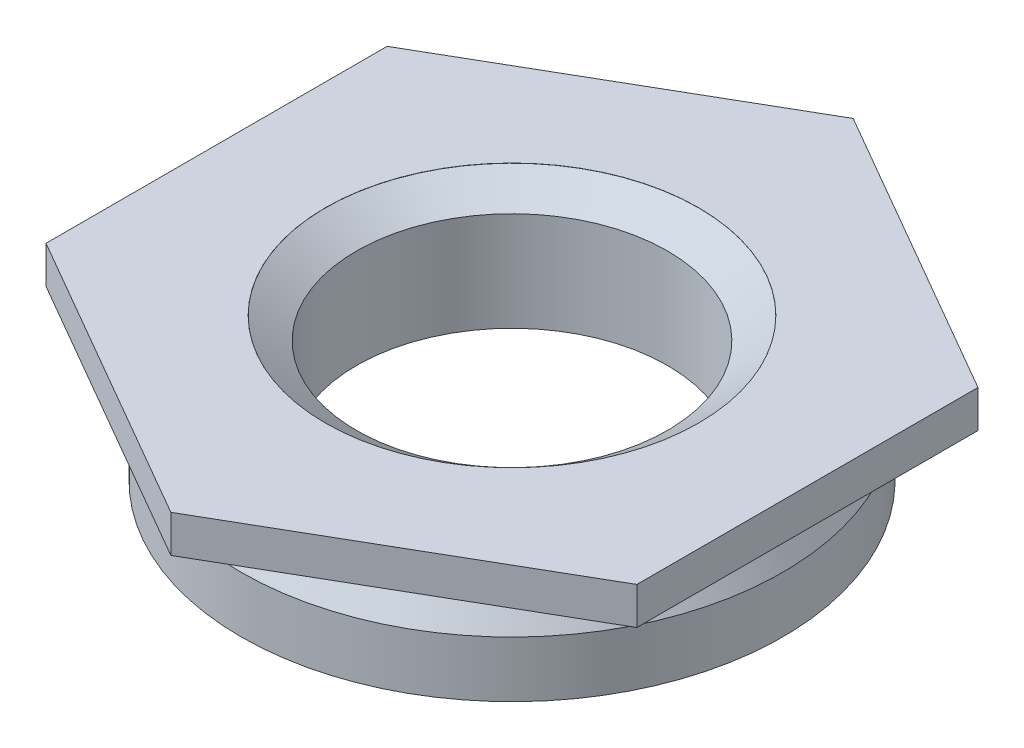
ISO-10303-21;
HEADER;
FILE_DESCRIPTION(('STEP AP214'),'2;1');
FILE_NAME('part.step','',(''),(''),'','','');
FILE_SCHEMA(('AUTOMOTIVE_DESIGN { 1 0 10303 214 1 1 1 1 }'));
ENDSEC;
DATA;
#1=APPLICATION_CONTEXT('core data for automotive mechanical design processes');
#2=APPLICATION_PROTOCOL_DEFINITION('international standard','automotive_design',2000,#1);
#3=PRODUCT_CONTEXT('',#1,'mechanical');
#4=PRODUCT('Part','Part','',(#3));
#5=PRODUCT_RELATED_PRODUCT_CATEGORY('part','',(#4));
#6=PRODUCT_DEFINITION_FORMATION('','',#4);
#7=PRODUCT_DEFINITION_CONTEXT('part definition',#1,'design');
#8=PRODUCT_DEFINITION('design','',#6,#7);
#9=PRODUCT_DEFINITION_SHAPE('','',#8);
#10=(LENGTH_UNIT() NAMED_UNIT(*) SI_UNIT(.MILLI.,.METRE.));
#11=(NAMED_UNIT(*) PLANE_ANGLE_UNIT() SI_UNIT($,.RADIAN.));
#12=(NAMED_UNIT(*) SI_UNIT($,.STERADIAN.) SOLID_ANGLE_UNIT());
#13=UNCERTAINTY_MEASURE_WITH_UNIT(LENGTH_MEASURE(1.E-05),#10,'distance_accuracy_value','');
#14=(GEOMETRIC_REPRESENTATION_CONTEXT(3) GLOBAL_UNCERTAINTY_ASSIGNED_CONTEXT((#13)) GLOBAL_UNIT_ASSIGNED_CONTEXT((#10,
#11,#12)) REPRESENTATION_CONTEXT('',''));
#15=CARTESIAN_POINT('',(0.,0.,0.));
#16=DIRECTION('',(0.,0.,1.));
#17=DIRECTION('',(1.,0.,0.));
#18=AXIS2_PLACEMENT_3D('',#15,#16,#17);
#19=CARTESIAN_POINT('',(4.06632486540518,0.,0.));
#20=DIRECTION('',(0.,-1.,0.));
#21=DIRECTION('',(0.,0.,-1.));
#22=AXIS2_PLACEMENT_3D('',#19,#20,#21);
#23=PLANE('',#22);
#24=CARTESIAN_POINT('',(0.,0.,0.));
#25=DIRECTION('',(0.,-1.,0.));
#26=DIRECTION('',(0.,0.,-1.));
#27=AXIS2_PLACEMENT_3D('',#24,#25,#26);
#28=CIRCLE('',#27,4.06632486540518);
#29=CARTESIAN_POINT('',(0.,0.,-4.06632486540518));
#30=VERTEX_POINT('',#29);
#31=EDGE_CURVE('E11',#30,#30,#28,.T.);
#32=ORIENTED_EDGE('',*,*,#31,.F.);
#33=EDGE_LOOP('',(#32));
#34=FACE_BOUND('',#33,.T.);
#35=DIRECTION('',(0.,0.,-1.));
#36=VECTOR('',#35,1.);
#37=CARTESIAN_POINT('',(4.75,0.,-2.74241377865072));
#38=LINE('',#37,#36);
#39=CARTESIAN_POINT('',(4.75,0.,2.74241377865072));
#40=VERTEX_POINT('',#39);
#41=CARTESIAN_POINT('',(4.75,0.,-2.74241377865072));
#42=VERTEX_POINT('',#41);
#43=EDGE_CURVE('E104',#40,#42,#38,.T.);
#44=ORIENTED_EDGE('',*,*,#43,.F.);
#45=DIRECTION('',(0.866025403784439,0.,-0.5));
#46=VECTOR('',#45,1.);
#47=CARTESIAN_POINT('',(4.75,0.,2.74241377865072));
#48=LINE('',#47,#46);
#49=CARTESIAN_POINT('',(0.,0.,5.48482755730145));
#50=VERTEX_POINT('',#49);
#51=EDGE_CURVE('E49',#50,#40,#48,.T.);
#52=ORIENTED_EDGE('',*,*,#51,.F.);
#53=DIRECTION('',(0.866025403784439,0.,0.5));
#54=VECTOR('',#53,1.);
#55=CARTESIAN_POINT('',(0.,0.,5.48482755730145));
#56=LINE('',#55,#54);
#57=CARTESIAN_POINT('',(-4.75,0.,2.74241377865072));
#58=VERTEX_POINT('',#57);
#59=EDGE_CURVE('E110',#58,#50,#56,.T.);
#60=ORIENTED_EDGE('',*,*,#59,.F.);
#61=DIRECTION('',(0.,0.,1.));
#62=VECTOR('',#61,1.);
#63=CARTESIAN_POINT('',(-4.75,0.,2.74241377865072));
#64=LINE('',#63,#62);
#65=CARTESIAN_POINT('',(-4.75,0.,-2.74241377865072));
#66=VERTEX_POINT('',#65);
#67=EDGE_CURVE('E108',#66,#58,#64,.T.);
#68=ORIENTED_EDGE('',*,*,#67,.F.);
#69=DIRECTION('',(-0.866025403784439,0.,0.5));
#70=VECTOR('',#69,1.);
#71=CARTESIAN_POINT('',(-4.75,0.,-2.74241377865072));
#72=LINE('',#71,#70);
#73=CARTESIAN_POINT('',(0.,0.,-5.48482755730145));
#74=VERTEX_POINT('',#73);
#75=EDGE_CURVE('E91',#74,#66,#72,.T.);
#76=ORIENTED_EDGE('',*,*,#75,.F.);
#77=DIRECTION('',(-0.866025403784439,0.,-0.5));
#78=VECTOR('',#77,1.);
#79=CARTESIAN_POINT('',(0.,0.,-5.48482755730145));
#80=LINE('',#79,#78);
#81=EDGE_CURVE('E99',#42,#74,#80,.T.);
#82=ORIENTED_EDGE('',*,*,#81,.F.);
#83=EDGE_LOOP('',(#44,#52,#60,#68,#76,#82));
#84=FACE_BOUND('',#83,.T.);
#85=ADVANCED_FACE('F33',(#34,#84),#23,.T.);
#86=CARTESIAN_POINT('',(5.5095,0.6,0.));
#87=DIRECTION('',(0.,1.,0.));
#88=DIRECTION('',(0.,0.,1.));
#89=AXIS2_PLACEMENT_3D('',#86,#87,#88);
#90=PLANE('',#89);
#91=CARTESIAN_POINT('',(0.,0.6,0.));
#92=DIRECTION('',(0.,1.,0.));
#93=DIRECTION('',(0.,0.,1.));
#94=AXIS2_PLACEMENT_3D('',#91,#92,#93);
#95=CIRCLE('',#94,3.);
#96=CARTESIAN_POINT('',(0.,0.6,3.));
#97=VERTEX_POINT('',#96);
#98=EDGE_CURVE('E36',#97,#97,#95,.T.);
#99=ORIENTED_EDGE('',*,*,#98,.F.);
#100=EDGE_LOOP('',(#99));
#101=FACE_BOUND('',#100,.T.);
#102=DIRECTION('',(0.866025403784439,0.,0.5));
#103=VECTOR('',#102,1.);
#104=CARTESIAN_POINT('',(0.,0.6,5.48482755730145));
#105=LINE('',#104,#103);
#106=CARTESIAN_POINT('',(-4.75,0.6,2.74241377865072));
#107=VERTEX_POINT('',#106);
#108=CARTESIAN_POINT('',(0.,0.6,5.48482755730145));
#109=VERTEX_POINT('',#108);
#110=EDGE_CURVE('E128',#107,#109,#105,.T.);
#111=ORIENTED_EDGE('',*,*,#110,.T.);
#112=DIRECTION('',(0.866025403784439,0.,-0.5));
#113=VECTOR('',#112,1.);
#114=CARTESIAN_POINT('',(4.75,0.6,2.74241377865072));
#115=LINE('',#114,#113);
#116=CARTESIAN_POINT('',(4.75,0.6,2.74241377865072));
#117=VERTEX_POINT('',#116);
#118=EDGE_CURVE('E117',#109,#117,#115,.T.);
#119=ORIENTED_EDGE('',*,*,#118,.T.);
#120=DIRECTION('',(0.,0.,-1.));
#121=VECTOR('',#120,1.);
#122=CARTESIAN_POINT('',(4.75,0.6,-2.74241377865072));
#123=LINE('',#122,#121);
#124=CARTESIAN_POINT('',(4.75,0.6,-2.74241377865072));
#125=VERTEX_POINT('',#124);
#126=EDGE_CURVE('E120',#117,#125,#123,.T.);
#127=ORIENTED_EDGE('',*,*,#126,.T.);
#128=DIRECTION('',(-0.866025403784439,0.,-0.5));
#129=VECTOR('',#128,1.);
#130=CARTESIAN_POINT('',(0.,0.6,-5.48482755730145));
#131=LINE('',#130,#129);
#132=CARTESIAN_POINT('',(0.,0.6,-5.48482755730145));
#133=VERTEX_POINT('',#132);
#134=EDGE_CURVE('E57',#125,#133,#131,.T.);
#135=ORIENTED_EDGE('',*,*,#134,.T.);
#136=DIRECTION('',(-0.866025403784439,0.,0.5));
#137=VECTOR('',#136,1.);
#138=CARTESIAN_POINT('',(-4.75,0.6,-2.74241377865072));
#139=LINE('',#138,#137);
#140=CARTESIAN_POINT('',(-4.75,0.6,-2.74241377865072));
#141=VERTEX_POINT('',#140);
#142=EDGE_CURVE('E94',#133,#141,#139,.T.);
#143=ORIENTED_EDGE('',*,*,#142,.T.);
#144=DIRECTION('',(0.,0.,1.));
#145=VECTOR('',#144,1.);
#146=CARTESIAN_POINT('',(-4.75,0.6,2.74241377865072));
#147=LINE('',#146,#145);
#148=EDGE_CURVE('E125',#141,#107,#147,.T.);
#149=ORIENTED_EDGE('',*,*,#148,.T.);
#150=EDGE_LOOP('',(#111,#119,#127,#135,#143,#149));
#151=FACE_BOUND('',#150,.T.);
#152=ADVANCED_FACE('F183',(#101,#151),#90,.T.);
#153=CARTESIAN_POINT('',(0.,0.,0.));
#154=DIRECTION('',(0.,-1.,0.));
#155=DIRECTION('',(0.,0.,-1.));
#156=AXIS2_PLACEMENT_3D('',#153,#154,#155);
#157=CYLINDRICAL_SURFACE('',#156,4.06632486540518);
#158=ORIENTED_EDGE('',*,*,#31,.T.);
#159=EDGE_LOOP('',(#158));
#160=FACE_BOUND('',#159,.T.);
#161=CARTESIAN_POINT('',(0.,-0.3,0.));
#162=DIRECTION('',(0.,-1.,0.));
#163=DIRECTION('',(0.,0.,-1.));
#164=AXIS2_PLACEMENT_3D('',#161,#162,#163);
#165=CIRCLE('',#164,4.06632486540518);
#166=CARTESIAN_POINT('',(0.,-0.3,-4.06632486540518));
#167=VERTEX_POINT('',#166);
#168=EDGE_CURVE('E41',#167,#167,#165,.T.);
#169=ORIENTED_EDGE('',*,*,#168,.F.);
#170=EDGE_LOOP('',(#169));
#171=FACE_BOUND('',#170,.T.);
#172=ADVANCED_FACE('F179',(#160,#171),#157,.T.);
#173=CARTESIAN_POINT('',(0.,-0.8,0.));
#174=DIRECTION('',(0.,-1.,0.));
#175=DIRECTION('',(0.,0.,-1.));
#176=AXIS2_PLACEMENT_3D('',#173,#174,#175);
#177=CONICAL_SURFACE('',#176,4.355,0.523598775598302);
#178=ORIENTED_EDGE('',*,*,#168,.T.);
#179=EDGE_LOOP('',(#178));
#180=FACE_BOUND('',#179,.T.);
#181=CARTESIAN_POINT('',(0.,-0.8,0.));
#182=DIRECTION('',(0.,-1.,0.));
#183=DIRECTION('',(0.,0.,-1.));
#184=AXIS2_PLACEMENT_3D('',#181,#182,#183);
#185=CIRCLE('',#184,4.355);
#186=CARTESIAN_POINT('',(0.,-0.8,-4.355));
#187=VERTEX_POINT('',#186);
#188=EDGE_CURVE('E154',#187,#187,#185,.T.);
#189=ORIENTED_EDGE('',*,*,#188,.F.);
#190=EDGE_LOOP('',(#189));
#191=FACE_BOUND('',#190,.T.);
#192=ADVANCED_FACE('F173',(#180,#191),#177,.T.);
#193=CARTESIAN_POINT('',(0.,0.,0.));
#194=DIRECTION('',(0.,-1.,0.));
#195=DIRECTION('',(0.,0.,-1.));
#196=AXIS2_PLACEMENT_3D('',#193,#194,#195);
#197=CYLINDRICAL_SURFACE('',#196,4.355);
#198=ORIENTED_EDGE('',*,*,#188,.T.);
#199=EDGE_LOOP('',(#198));
#200=FACE_BOUND('',#199,.T.);
#201=CARTESIAN_POINT('',(0.,-1.7,0.));
#202=DIRECTION('',(0.,-1.,0.));
#203=DIRECTION('',(0.,0.,-1.));
#204=AXIS2_PLACEMENT_3D('',#201,#202,#203);
#205=CIRCLE('',#204,4.355);
#206=CARTESIAN_POINT('',(0.,-1.7,-4.355));
#207=VERTEX_POINT('',#206);
#208=EDGE_CURVE('E151',#207,#207,#205,.T.);
#209=ORIENTED_EDGE('',*,*,#208,.F.);
#210=EDGE_LOOP('',(#209));
#211=FACE_BOUND('',#210,.T.);
#212=ADVANCED_FACE('F168',(#200,#211),#197,.T.);
#213=CARTESIAN_POINT('',(2.5,-1.7,0.));
#214=DIRECTION('',(0.,-1.,0.));
#215=DIRECTION('',(0.,0.,-1.));
#216=AXIS2_PLACEMENT_3D('',#213,#214,#215);
#217=PLANE('',#216);
#218=CARTESIAN_POINT('',(0.,-1.7,0.));
#219=DIRECTION('',(0.,-1.,0.));
#220=DIRECTION('',(0.,0.,-1.));
#221=AXIS2_PLACEMENT_3D('',#218,#219,#220);
#222=CIRCLE('',#221,3.);
#223=CARTESIAN_POINT('',(0.,-1.7,-3.));
#224=VERTEX_POINT('',#223);
#225=EDGE_CURVE('E150',#224,#224,#222,.T.);
#226=ORIENTED_EDGE('',*,*,#225,.F.);
#227=EDGE_LOOP('',(#226));
#228=FACE_BOUND('',#227,.T.);
#229=ORIENTED_EDGE('',*,*,#208,.T.);
#230=EDGE_LOOP('',(#229));
#231=FACE_BOUND('',#230,.T.);
#232=ADVANCED_FACE('F164',(#228,#231),#217,.T.);
#233=CARTESIAN_POINT('',(0.,0.,0.));
#234=DIRECTION('',(0.,-1.,0.));
#235=DIRECTION('',(0.,0.,-1.));
#236=AXIS2_PLACEMENT_3D('',#233,#234,#235);
#237=CYLINDRICAL_SURFACE('',#236,2.5);
#238=CARTESIAN_POINT('',(0.,0.247486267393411,0.));
#239=DIRECTION('',(0.,-1.,0.));
#240=DIRECTION('',(0.,0.,-1.));
#241=AXIS2_PLACEMENT_3D('',#238,#239,#240);
#242=CIRCLE('',#241,2.5);
#243=CARTESIAN_POINT('',(0.,0.247486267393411,-2.5));
#244=VERTEX_POINT('',#243);
#245=EDGE_CURVE('E141',#244,#244,#242,.T.);
#246=ORIENTED_EDGE('',*,*,#245,.F.);
#247=EDGE_LOOP('',(#246));
#248=FACE_BOUND('',#247,.T.);
#249=CARTESIAN_POINT('',(0.,-1.34748626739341,0.));
#250=DIRECTION('',(0.,-1.,0.));
#251=DIRECTION('',(0.,0.,-1.));
#252=AXIS2_PLACEMENT_3D('',#249,#250,#251);
#253=CIRCLE('',#252,2.5);
#254=CARTESIAN_POINT('',(0.,-1.34748626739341,-2.5));
#255=VERTEX_POINT('',#254);
#256=EDGE_CURVE('E144',#255,#255,#253,.T.);
#257=ORIENTED_EDGE('',*,*,#256,.T.);
#258=EDGE_LOOP('',(#257));
#259=FACE_BOUND('',#258,.T.);
#260=ADVANCED_FACE('F167',(#248,#259),#237,.F.);
#261=CARTESIAN_POINT('',(0.,-2.54,0.));
#262=DIRECTION('',(0.,-1.,0.));
#263=DIRECTION('',(0.,0.,-1.));
#264=AXIS2_PLACEMENT_3D('',#261,#262,#263);
#265=CYLINDRICAL_SURFACE('',#264,3.);
#266=ORIENTED_EDGE('',*,*,#225,.T.);
#267=EDGE_LOOP('',(#266));
#268=FACE_BOUND('',#267,.T.);
#269=CARTESIAN_POINT('',(0.,-1.69746,0.));
#270=DIRECTION('',(0.,-1.,0.));
#271=DIRECTION('',(0.,0.,-1.));
#272=AXIS2_PLACEMENT_3D('',#269,#270,#271);
#273=CIRCLE('',#272,3.);
#274=CARTESIAN_POINT('',(0.,-1.69746,-3.));
#275=VERTEX_POINT('',#274);
#276=EDGE_CURVE('E147',#275,#275,#273,.T.);
#277=ORIENTED_EDGE('',*,*,#276,.F.);
#278=EDGE_LOOP('',(#277));
#279=FACE_BOUND('',#278,.T.);
#280=ADVANCED_FACE('F161',(#268,#279),#265,.F.);
#281=CARTESIAN_POINT('',(0.,-1.69746,0.));
#282=DIRECTION('',(0.,-1.,0.));
#283=DIRECTION('',(0.,0.,-1.));
#284=AXIS2_PLACEMENT_3D('',#281,#282,#283);
#285=CONICAL_SURFACE('',#284,3.,0.960105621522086);
#286=ORIENTED_EDGE('',*,*,#256,.F.);
#287=EDGE_LOOP('',(#286));
#288=FACE_BOUND('',#287,.T.);
#289=ORIENTED_EDGE('',*,*,#276,.T.);
#290=EDGE_LOOP('',(#289));
#291=FACE_BOUND('',#290,.T.);
#292=ADVANCED_FACE('F233',(#288,#291),#285,.F.);
#293=CARTESIAN_POINT('',(0.,-2.54,0.));
#294=DIRECTION('',(0.,-1.,0.));
#295=DIRECTION('',(0.,0.,-1.));
#296=AXIS2_PLACEMENT_3D('',#293,#294,#295);
#297=CYLINDRICAL_SURFACE('',#296,3.);
#298=ORIENTED_EDGE('',*,*,#98,.T.);
#299=EDGE_LOOP('',(#298));
#300=FACE_BOUND('',#299,.T.);
#301=CARTESIAN_POINT('',(0.,0.59746,0.));
#302=DIRECTION('',(0.,-1.,0.));
#303=DIRECTION('',(0.,0.,-1.));
#304=AXIS2_PLACEMENT_3D('',#301,#302,#303);
#305=CIRCLE('',#304,3.);
#306=CARTESIAN_POINT('',(0.,0.59746,-3.));
#307=VERTEX_POINT('',#306);
#308=EDGE_CURVE('E133',#307,#307,#305,.T.);
#309=ORIENTED_EDGE('',*,*,#308,.T.);
#310=EDGE_LOOP('',(#309));
#311=FACE_BOUND('',#310,.T.);
#312=ADVANCED_FACE('F242',(#300,#311),#297,.F.);
#313=CARTESIAN_POINT('',(0.,0.247486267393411,0.));
#314=DIRECTION('',(0.,1.,0.));
#315=DIRECTION('',(0.,0.,1.));
#316=AXIS2_PLACEMENT_3D('',#313,#314,#315);
#317=CONICAL_SURFACE('',#316,2.5,0.960105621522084);
#318=ORIENTED_EDGE('',*,*,#308,.F.);
#319=EDGE_LOOP('',(#318));
#320=FACE_BOUND('',#319,.T.);
#321=ORIENTED_EDGE('',*,*,#245,.T.);
#322=EDGE_LOOP('',(#321));
#323=FACE_BOUND('',#322,.T.);
#324=ADVANCED_FACE('F252',(#320,#323),#317,.F.);
#325=CARTESIAN_POINT('',(4.75,0.,2.74241377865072));
#326=DIRECTION('',(0.5,0.,0.866025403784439));
#327=DIRECTION('',(0.866025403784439,0.,-0.5));
#328=AXIS2_PLACEMENT_3D('',#325,#326,#327);
#329=PLANE('',#328);
#330=ORIENTED_EDGE('',*,*,#118,.F.);
#331=DIRECTION('',(0.,1.,0.));
#332=VECTOR('',#331,1.);
#333=CARTESIAN_POINT('',(0.,0.,5.48482755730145));
#334=LINE('',#333,#332);
#335=EDGE_CURVE('E131',#50,#109,#334,.T.);
#336=ORIENTED_EDGE('',*,*,#335,.F.);
#337=ORIENTED_EDGE('',*,*,#51,.T.);
#338=DIRECTION('',(0.,1.,0.));
#339=VECTOR('',#338,1.);
#340=CARTESIAN_POINT('',(4.75,0.,2.74241377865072));
#341=LINE('',#340,#339);
#342=EDGE_CURVE('E116',#40,#117,#341,.T.);
#343=ORIENTED_EDGE('',*,*,#342,.T.);
#344=EDGE_LOOP('',(#330,#336,#337,#343));
#345=FACE_BOUND('',#344,.T.);
#346=ADVANCED_FACE('F261',(#345),#329,.T.);
#347=CARTESIAN_POINT('',(0.,0.,5.48482755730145));
#348=DIRECTION('',(-0.5,0.,0.866025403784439));
#349=DIRECTION('',(0.866025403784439,0.,0.5));
#350=AXIS2_PLACEMENT_3D('',#347,#348,#349);
#351=PLANE('',#350);
#352=ORIENTED_EDGE('',*,*,#110,.F.);
#353=DIRECTION('',(0.,1.,0.));
#354=VECTOR('',#353,1.);
#355=CARTESIAN_POINT('',(-4.75,0.,2.74241377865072));
#356=LINE('',#355,#354);
#357=EDGE_CURVE('E134',#58,#107,#356,.T.);
#358=ORIENTED_EDGE('',*,*,#357,.F.);
#359=ORIENTED_EDGE('',*,*,#59,.T.);
#360=ORIENTED_EDGE('',*,*,#335,.T.);
#361=EDGE_LOOP('',(#352,#358,#359,#360));
#362=FACE_BOUND('',#361,.T.);
#363=ADVANCED_FACE('F280',(#362),#351,.T.);
#364=CARTESIAN_POINT('',(-4.75,0.,2.74241377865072));
#365=DIRECTION('',(-1.,0.,0.));
#366=DIRECTION('',(0.,0.,1.));
#367=AXIS2_PLACEMENT_3D('',#364,#365,#366);
#368=PLANE('',#367);
#369=ORIENTED_EDGE('',*,*,#148,.F.);
#370=DIRECTION('',(0.,1.,0.));
#371=VECTOR('',#370,1.);
#372=CARTESIAN_POINT('',(-4.75,0.,-2.74241377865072));
#373=LINE('',#372,#371);
#374=EDGE_CURVE('E95',#66,#141,#373,.T.);
#375=ORIENTED_EDGE('',*,*,#374,.F.);
#376=ORIENTED_EDGE('',*,*,#67,.T.);
#377=ORIENTED_EDGE('',*,*,#357,.T.);
#378=EDGE_LOOP('',(#369,#375,#376,#377));
#379=FACE_BOUND('',#378,.T.);
#380=ADVANCED_FACE('F289',(#379),#368,.T.);
#381=CARTESIAN_POINT('',(-4.75,0.,-2.74241377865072));
#382=DIRECTION('',(-0.5,0.,-0.866025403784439));
#383=DIRECTION('',(-0.866025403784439,0.,0.5));
#384=AXIS2_PLACEMENT_3D('',#381,#382,#383);
#385=PLANE('',#384);
#386=ORIENTED_EDGE('',*,*,#142,.F.);
#387=DIRECTION('',(0.,1.,0.));
#388=VECTOR('',#387,1.);
#389=CARTESIAN_POINT('',(0.,0.,-5.48482755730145));
#390=LINE('',#389,#388);
#391=EDGE_CURVE('E87',#74,#133,#390,.T.);
#392=ORIENTED_EDGE('',*,*,#391,.F.);
#393=ORIENTED_EDGE('',*,*,#75,.T.);
#394=ORIENTED_EDGE('',*,*,#374,.T.);
#395=EDGE_LOOP('',(#386,#392,#393,#394));
#396=FACE_BOUND('',#395,.T.);
#397=ADVANCED_FACE('F89',(#396),#385,.T.);
#398=CARTESIAN_POINT('',(0.,0.,-5.48482755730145));
#399=DIRECTION('',(0.5,0.,-0.866025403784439));
#400=DIRECTION('',(-0.866025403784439,0.,-0.5));
#401=AXIS2_PLACEMENT_3D('',#398,#399,#400);
#402=PLANE('',#401);
#403=ORIENTED_EDGE('',*,*,#134,.F.);
#404=DIRECTION('',(0.,1.,0.));
#405=VECTOR('',#404,1.);
#406=CARTESIAN_POINT('',(4.75,0.,-2.74241377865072));
#407=LINE('',#406,#405);
#408=EDGE_CURVE('E96',#42,#125,#407,.T.);
#409=ORIENTED_EDGE('',*,*,#408,.F.);
#410=ORIENTED_EDGE('',*,*,#81,.T.);
#411=ORIENTED_EDGE('',*,*,#391,.T.);
#412=EDGE_LOOP('',(#403,#409,#410,#411));
#413=FACE_BOUND('',#412,.T.);
#414=ADVANCED_FACE('F100',(#413),#402,.T.);
#415=CARTESIAN_POINT('',(4.75,0.,-2.74241377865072));
#416=DIRECTION('',(1.,0.,0.));
#417=DIRECTION('',(0.,0.,-1.));
#418=AXIS2_PLACEMENT_3D('',#415,#416,#417);
#419=PLANE('',#418);
#420=ORIENTED_EDGE('',*,*,#126,.F.);
#421=ORIENTED_EDGE('',*,*,#342,.F.);
#422=ORIENTED_EDGE('',*,*,#43,.T.);
#423=ORIENTED_EDGE('',*,*,#408,.T.);
#424=EDGE_LOOP('',(#420,#421,#422,#423));
#425=FACE_BOUND('',#424,.T.);
#426=ADVANCED_FACE('F316',(#425),#419,.T.);
#427=CLOSED_SHELL('',(#85,#152,#172,#192,#212,#232,#260,#280,#292,#312,#324,#346,#363,#380,#397,
#414,#426));
#428=MANIFOLD_SOLID_BREP('B2',#427);
#429=ADVANCED_BREP_SHAPE_REPRESENTATION('',(#18,#428),#14);
#430=SHAPE_DEFINITION_REPRESENTATION(#9,#429);
ENDSEC;
END-ISO-10303-21;
